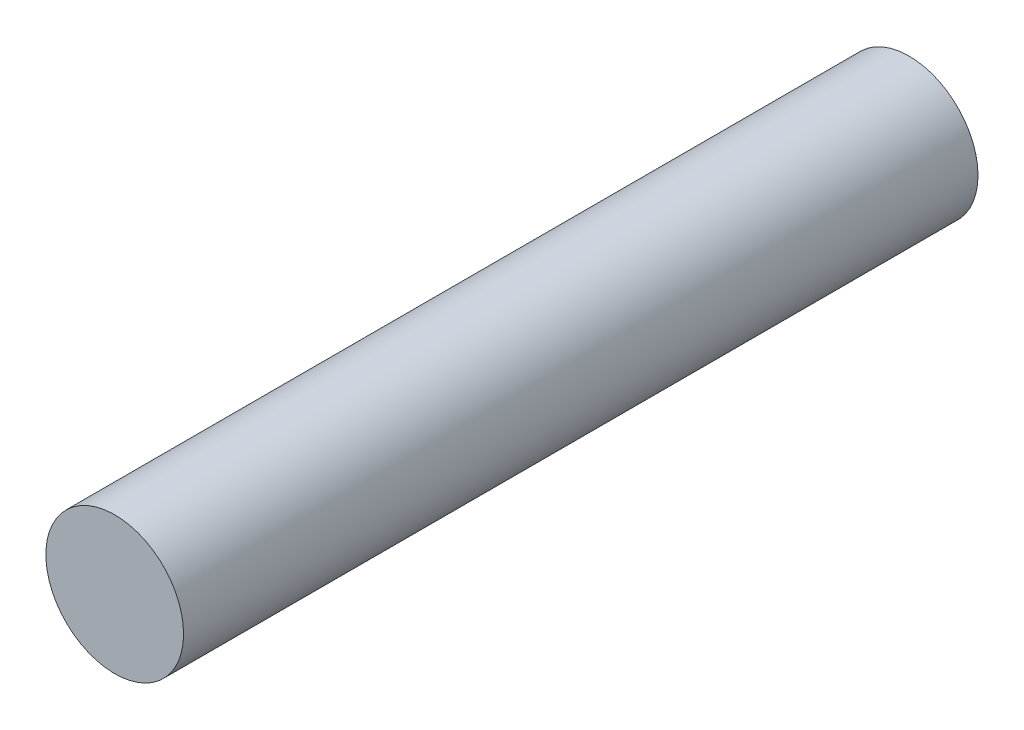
ISO-10303-21;
HEADER;
FILE_DESCRIPTION(('STEP AP214'),'2;1');
FILE_NAME('part.step','',(''),(''),'','','');
FILE_SCHEMA(('AUTOMOTIVE_DESIGN { 1 0 10303 214 1 1 1 1 }'));
ENDSEC;
DATA;
#1=APPLICATION_CONTEXT('core data for automotive mechanical design processes');
#2=APPLICATION_PROTOCOL_DEFINITION('international standard','automotive_design',2000,#1);
#3=PRODUCT_CONTEXT('',#1,'mechanical');
#4=PRODUCT('Part','Part','',(#3));
#5=PRODUCT_RELATED_PRODUCT_CATEGORY('part','',(#4));
#6=PRODUCT_DEFINITION_FORMATION('','',#4);
#7=PRODUCT_DEFINITION_CONTEXT('part definition',#1,'design');
#8=PRODUCT_DEFINITION('design','',#6,#7);
#9=PRODUCT_DEFINITION_SHAPE('','',#8);
#10=(LENGTH_UNIT() NAMED_UNIT(*) SI_UNIT(.MILLI.,.METRE.));
#11=(NAMED_UNIT(*) PLANE_ANGLE_UNIT() SI_UNIT($,.RADIAN.));
#12=(NAMED_UNIT(*) SI_UNIT($,.STERADIAN.) SOLID_ANGLE_UNIT());
#13=UNCERTAINTY_MEASURE_WITH_UNIT(LENGTH_MEASURE(1.E-05),#10,'distance_accuracy_value','');
#14=(GEOMETRIC_REPRESENTATION_CONTEXT(3) GLOBAL_UNCERTAINTY_ASSIGNED_CONTEXT((#13)) GLOBAL_UNIT_ASSIGNED_CONTEXT((#10,
#11,#12)) REPRESENTATION_CONTEXT('',''));
#15=CARTESIAN_POINT('',(0.,0.,0.));
#16=DIRECTION('',(0.,0.,1.));
#17=DIRECTION('',(1.,0.,0.));
#18=AXIS2_PLACEMENT_3D('',#15,#16,#17);
#19=CARTESIAN_POINT('',(0.,0.,1200.));
#20=DIRECTION('',(0.,0.,-1.));
#21=DIRECTION('',(-1.,0.,0.));
#22=AXIS2_PLACEMENT_3D('',#19,#20,#21);
#23=CYLINDRICAL_SURFACE('',#22,104.);
#24=CARTESIAN_POINT('',(0.,0.,1200.));
#25=DIRECTION('',(0.,0.,1.));
#26=DIRECTION('',(1.,0.,0.));
#27=AXIS2_PLACEMENT_3D('',#24,#25,#26);
#28=CIRCLE('',#27,104.);
#29=CARTESIAN_POINT('',(104.,0.,1200.));
#30=VERTEX_POINT('',#29);
#31=EDGE_CURVE('E10',#30,#30,#28,.T.);
#32=ORIENTED_EDGE('',*,*,#31,.F.);
#33=EDGE_LOOP('',(#32));
#34=FACE_BOUND('',#33,.T.);
#35=CARTESIAN_POINT('',(0.,0.,0.));
#36=DIRECTION('',(0.,0.,1.));
#37=DIRECTION('',(1.,0.,0.));
#38=AXIS2_PLACEMENT_3D('',#35,#36,#37);
#39=CIRCLE('',#38,104.);
#40=CARTESIAN_POINT('',(104.,0.,0.));
#41=VERTEX_POINT('',#40);
#42=EDGE_CURVE('E35',#41,#41,#39,.T.);
#43=ORIENTED_EDGE('',*,*,#42,.T.);
#44=EDGE_LOOP('',(#43));
#45=FACE_BOUND('',#44,.T.);
#46=ADVANCED_FACE('F29',(#34,#45),#23,.T.);
#47=CARTESIAN_POINT('',(0.,0.,1200.));
#48=DIRECTION('',(0.,0.,1.));
#49=DIRECTION('',(1.,0.,0.));
#50=AXIS2_PLACEMENT_3D('',#47,#48,#49);
#51=PLANE('',#50);
#52=ORIENTED_EDGE('',*,*,#31,.T.);
#53=EDGE_LOOP('',(#52));
#54=FACE_BOUND('',#53,.T.);
#55=ADVANCED_FACE('F44',(#54),#51,.T.);
#56=CARTESIAN_POINT('',(0.,0.,0.));
#57=DIRECTION('',(0.,0.,1.));
#58=DIRECTION('',(1.,0.,0.));
#59=AXIS2_PLACEMENT_3D('',#56,#57,#58);
#60=PLANE('',#59);
#61=ORIENTED_EDGE('',*,*,#42,.F.);
#62=EDGE_LOOP('',(#61));
#63=FACE_BOUND('',#62,.T.);
#64=ADVANCED_FACE('F42',(#63),#60,.F.);
#65=CLOSED_SHELL('',(#46,#55,#64));
#66=MANIFOLD_SOLID_BREP('B2',#65);
#67=ADVANCED_BREP_SHAPE_REPRESENTATION('',(#18,#66),#14);
#68=SHAPE_DEFINITION_REPRESENTATION(#9,#67);
ENDSEC;
END-ISO-10303-21;
